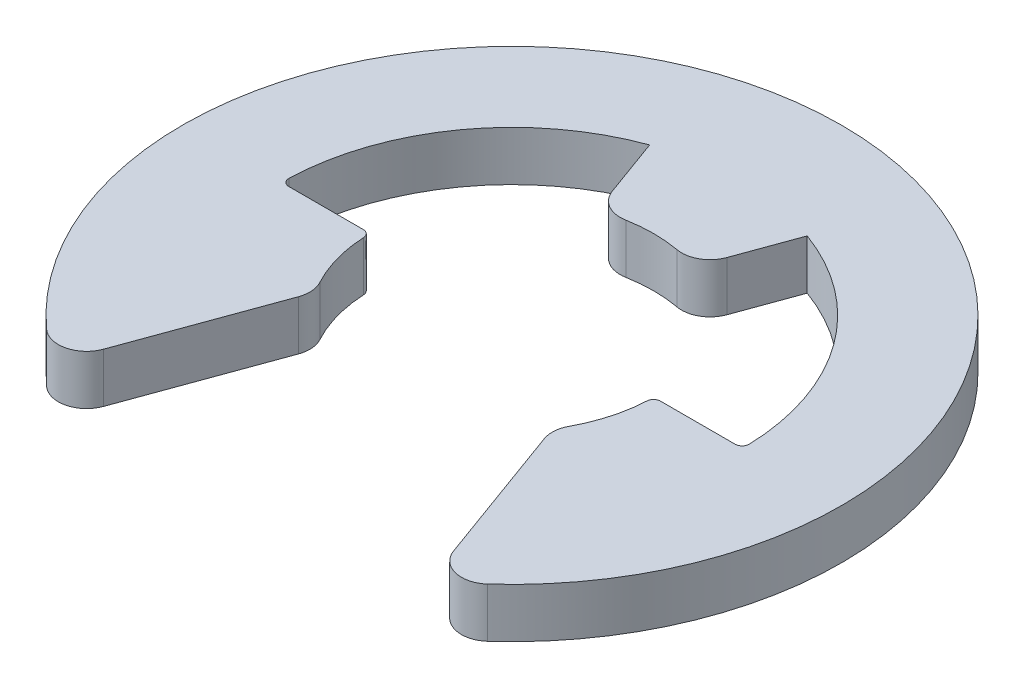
from build123d import *

# Parameters (mm, degrees)
BOSS_EXTRUDE1_DEPTH = 0.35
FILLET1_R           = 0.4
FILLET2_R           = 0.1


with BuildPart() as part:
    # Sketch2 → Boss-Extrude1 (new, symmetric)
    with BuildSketch(Plane(origin=(0, 0, 0), x_dir=(1, 0, 0), z_dir=(0, 1, 0))):
        with BuildLine():
            Line((-2.658123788, -3.815347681), (-1.67, -1.100499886))
            ThreePointArc((-1.67, -1.100499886), (-1.915724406, -0.574456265), (-2, 0))
            Line((-2, 0), (-3.25, 0))
            ThreePointArc((-3.25, 0), (-2.662244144, 1.864123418), (-1.111565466, 3.054001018))
            Line((-1.111565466, 3.054001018), (-0.684040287, 1.879385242))
            ThreePointArc((-0.684040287, 1.879385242), (0, 2), (0.684040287, 1.879385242))
            Line((0.684040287, 1.879385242), (1.111565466, 3.054001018))
            ThreePointArc((1.111565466, 3.054001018), (2.662244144, 1.864123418), (3.25, 0))
            Line((3.25, 0), (2, 0))
            ThreePointArc((2, 0), (1.915724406, -0.574456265), (1.67, -1.100499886))
            Line((1.67, -1.100499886), (2.658123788, -3.815347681))
            ThreePointArc((2.658123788, -3.815347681), (0, 4.65), (-2.658123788, -3.815347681))
        make_face()
    extrude(amount=BOSS_EXTRUDE1_DEPTH, both=True)

    # Fillet1
    fillet1_edges = [part.edges().sort_by_distance(p)[0] for p in [
        (-1.67, 0, 1.100499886),
        (-2.658123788, 0, 3.815347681),
        (2.658123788, 0, 3.815347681),
        (1.67, 0, 1.100499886),
        (0.684040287, 0, -1.879385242),
        (-0.684040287, 0, -1.879385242),
    ]]
    fillet(fillet1_edges, radius=FILLET1_R)

    # Fillet2
    fillet2_edges = [part.edges().sort_by_distance(p)[0] for p in [
        (-3.25, 0, 0),
        (-2, 0, 0),
        (2, 0, 0),
        (3.25, 0, 0),
    ]]
    fillet(fillet2_edges, radius=FILLET2_R)


solid = part.part
